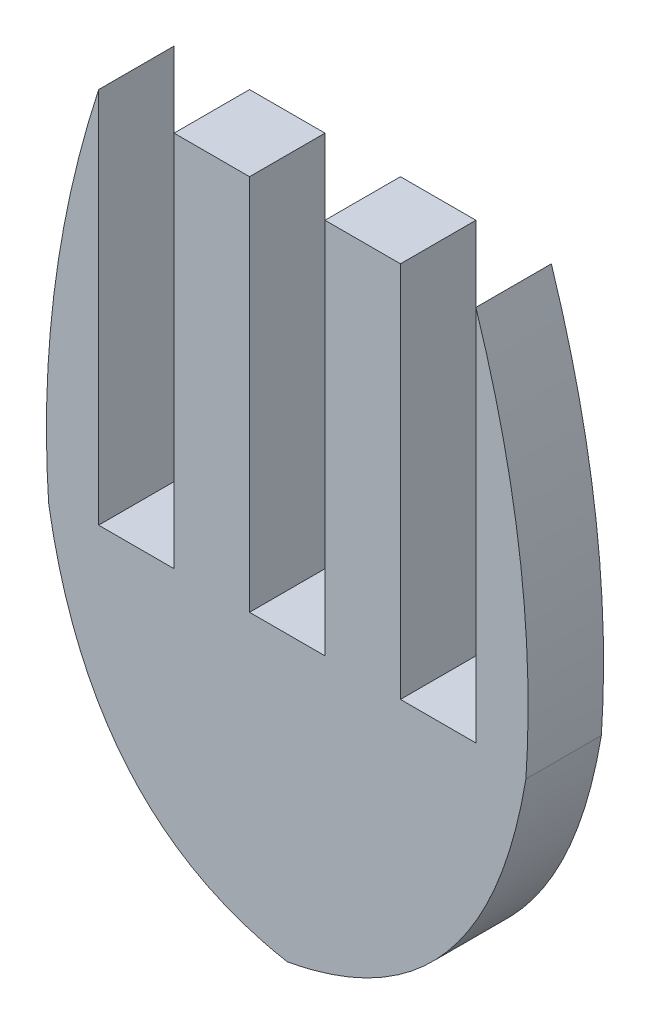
ISO-10303-21;
HEADER;
FILE_DESCRIPTION(('STEP AP214'),'2;1');
FILE_NAME('part.step','',(''),(''),'','','');
FILE_SCHEMA(('AUTOMOTIVE_DESIGN { 1 0 10303 214 1 1 1 1 }'));
ENDSEC;
DATA;
#1=APPLICATION_CONTEXT('core data for automotive mechanical design processes');
#2=APPLICATION_PROTOCOL_DEFINITION('international standard','automotive_design',2000,#1);
#3=PRODUCT_CONTEXT('',#1,'mechanical');
#4=PRODUCT('Part','Part','',(#3));
#5=PRODUCT_RELATED_PRODUCT_CATEGORY('part','',(#4));
#6=PRODUCT_DEFINITION_FORMATION('','',#4);
#7=PRODUCT_DEFINITION_CONTEXT('part definition',#1,'design');
#8=PRODUCT_DEFINITION('design','',#6,#7);
#9=PRODUCT_DEFINITION_SHAPE('','',#8);
#10=(LENGTH_UNIT() NAMED_UNIT(*) SI_UNIT(.MILLI.,.METRE.));
#11=(NAMED_UNIT(*) PLANE_ANGLE_UNIT() SI_UNIT($,.RADIAN.));
#12=(NAMED_UNIT(*) SI_UNIT($,.STERADIAN.) SOLID_ANGLE_UNIT());
#13=UNCERTAINTY_MEASURE_WITH_UNIT(LENGTH_MEASURE(1.E-05),#10,'distance_accuracy_value','');
#14=(GEOMETRIC_REPRESENTATION_CONTEXT(3) GLOBAL_UNCERTAINTY_ASSIGNED_CONTEXT((#13)) GLOBAL_UNIT_ASSIGNED_CONTEXT((#10,
#11,#12)) REPRESENTATION_CONTEXT('',''));
#15=CARTESIAN_POINT('',(0.,0.,0.));
#16=DIRECTION('',(0.,0.,1.));
#17=DIRECTION('',(1.,0.,0.));
#18=AXIS2_PLACEMENT_3D('',#15,#16,#17);
#19=CARTESIAN_POINT('',(-7.03477586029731,2.29793960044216,3.));
#20=DIRECTION('',(0.,1.,0.));
#21=DIRECTION('',(0.,0.,1.));
#22=AXIS2_PLACEMENT_3D('',#19,#20,#21);
#23=PLANE('',#22);
#24=DIRECTION('',(1.,0.,0.));
#25=VECTOR('',#24,1.);
#26=CARTESIAN_POINT('',(-7.03477586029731,2.29793960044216,0.));
#27=LINE('',#26,#25);
#28=CARTESIAN_POINT('',(-7.03477586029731,2.29793960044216,0.));
#29=VERTEX_POINT('',#28);
#30=CARTESIAN_POINT('',(-4.03477586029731,2.29793960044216,0.));
#31=VERTEX_POINT('',#30);
#32=EDGE_CURVE('E271',#29,#31,#27,.T.);
#33=ORIENTED_EDGE('',*,*,#32,.F.);
#34=DIRECTION('',(0.,0.,-1.));
#35=VECTOR('',#34,1.);
#36=CARTESIAN_POINT('',(-7.03477586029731,2.29793960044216,3.));
#37=LINE('',#36,#35);
#38=CARTESIAN_POINT('',(-7.03477586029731,2.29793960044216,3.));
#39=VERTEX_POINT('',#38);
#40=EDGE_CURVE('E11',#39,#29,#37,.T.);
#41=ORIENTED_EDGE('',*,*,#40,.F.);
#42=DIRECTION('',(1.,0.,0.));
#43=VECTOR('',#42,1.);
#44=CARTESIAN_POINT('',(-7.03477586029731,2.29793960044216,3.));
#45=LINE('',#44,#43);
#46=CARTESIAN_POINT('',(-4.03477586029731,2.29793960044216,3.));
#47=VERTEX_POINT('',#46);
#48=EDGE_CURVE('E237',#39,#47,#45,.T.);
#49=ORIENTED_EDGE('',*,*,#48,.T.);
#50=DIRECTION('',(0.,0.,-1.));
#51=VECTOR('',#50,1.);
#52=CARTESIAN_POINT('',(-4.03477586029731,2.29793960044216,3.));
#53=LINE('',#52,#51);
#54=EDGE_CURVE('E42',#47,#31,#53,.T.);
#55=ORIENTED_EDGE('',*,*,#54,.T.);
#56=EDGE_LOOP('',(#33,#41,#49,#55));
#57=FACE_BOUND('',#56,.T.);
#58=ADVANCED_FACE('F39',(#57),#23,.T.);
#59=CARTESIAN_POINT('',(-7.03477586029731,17.2979396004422,3.));
#60=DIRECTION('',(1.,0.,0.));
#61=DIRECTION('',(0.,1.,0.));
#62=AXIS2_PLACEMENT_3D('',#59,#60,#61);
#63=PLANE('',#62);
#64=DIRECTION('',(0.,-1.,0.));
#65=VECTOR('',#64,1.);
#66=CARTESIAN_POINT('',(-7.03477586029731,17.2979396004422,0.));
#67=LINE('',#66,#65);
#68=CARTESIAN_POINT('',(-7.03477586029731,17.2979396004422,0.));
#69=VERTEX_POINT('',#68);
#70=EDGE_CURVE('E238',#69,#29,#67,.T.);
#71=ORIENTED_EDGE('',*,*,#70,.F.);
#72=DIRECTION('',(0.,0.,-1.));
#73=VECTOR('',#72,1.);
#74=CARTESIAN_POINT('',(-7.03477586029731,17.2979396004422,3.));
#75=LINE('',#74,#73);
#76=CARTESIAN_POINT('',(-7.03477586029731,17.2979396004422,3.));
#77=VERTEX_POINT('',#76);
#78=EDGE_CURVE('E48',#77,#69,#75,.T.);
#79=ORIENTED_EDGE('',*,*,#78,.F.);
#80=DIRECTION('',(0.,-1.,0.));
#81=VECTOR('',#80,1.);
#82=CARTESIAN_POINT('',(-7.03477586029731,17.2979396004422,3.));
#83=LINE('',#82,#81);
#84=EDGE_CURVE('E158',#77,#39,#83,.T.);
#85=ORIENTED_EDGE('',*,*,#84,.T.);
#86=ORIENTED_EDGE('',*,*,#40,.T.);
#87=EDGE_LOOP('',(#71,#79,#85,#86));
#88=FACE_BOUND('',#87,.T.);
#89=ADVANCED_FACE('F364',(#88),#63,.T.);
#90=CARTESIAN_POINT('',(-7.03477586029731,17.2979396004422,3.));
#91=CARTESIAN_POINT('',(-9.53500148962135,9.55546838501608,3.));
#92=CARTESIAN_POINT('',(-9.0227830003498,2.04965131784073,3.));
#93=B_SPLINE_CURVE_WITH_KNOTS('',2,(#90,#91,#92),.UNSPECIFIED.,.F.,.F.,(3,3),(0.,
0.883494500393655),.UNSPECIFIED.);
#94=DIRECTION('',(0.,0.,-1.));
#95=VECTOR('',#94,1.);
#96=SURFACE_OF_LINEAR_EXTRUSION('',#93,#95);
#97=CARTESIAN_POINT('',(-7.03477586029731,17.2979396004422,0.));
#98=CARTESIAN_POINT('',(-9.53500148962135,9.55546838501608,0.));
#99=CARTESIAN_POINT('',(-9.0227830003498,2.04965131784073,0.));
#100=B_SPLINE_CURVE_WITH_KNOTS('',2,(#97,#98,#99),.UNSPECIFIED.,.F.,.F.,(3,3),(0.,
0.883494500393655),.UNSPECIFIED.);
#101=CARTESIAN_POINT('',(-9.0227830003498,2.04965131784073,0.));
#102=VERTEX_POINT('',#101);
#103=EDGE_CURVE('E163',#69,#102,#100,.T.);
#104=ORIENTED_EDGE('',*,*,#103,.T.);
#105=DIRECTION('',(0.,0.,-1.));
#106=VECTOR('',#105,1.);
#107=CARTESIAN_POINT('',(-9.0227830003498,2.04965131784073,3.));
#108=LINE('',#107,#106);
#109=CARTESIAN_POINT('',(-9.0227830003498,2.04965131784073,3.));
#110=VERTEX_POINT('',#109);
#111=EDGE_CURVE('E161',#110,#102,#108,.T.);
#112=ORIENTED_EDGE('',*,*,#111,.F.);
#113=EDGE_CURVE('E151',#77,#110,#93,.T.);
#114=ORIENTED_EDGE('',*,*,#113,.F.);
#115=ORIENTED_EDGE('',*,*,#78,.T.);
#116=EDGE_LOOP('',(#104,#112,#114,#115));
#117=FACE_BOUND('',#116,.T.);
#118=ADVANCED_FACE('F162',(#117),#96,.F.);
#119=CARTESIAN_POINT('',(-9.0227830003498,2.04965131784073,3.));
#120=CARTESIAN_POINT('',(-7.40663522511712,-7.56443030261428,3.));
#121=CARTESIAN_POINT('',(0.465224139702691,-8.98733026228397,3.));
#122=B_SPLINE_CURVE_WITH_KNOTS('',2,(#119,#120,#121),.UNSPECIFIED.,.F.,.F.,(3,3),(0.,1.),.UNSPECIFIED.);
#123=DIRECTION('',(0.,0.,-1.));
#124=VECTOR('',#123,1.);
#125=SURFACE_OF_LINEAR_EXTRUSION('',#122,#124);
#126=CARTESIAN_POINT('',(-9.0227830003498,2.04965131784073,0.));
#127=CARTESIAN_POINT('',(-7.40663522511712,-7.56443030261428,0.));
#128=CARTESIAN_POINT('',(0.465224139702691,-8.98733026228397,0.));
#129=B_SPLINE_CURVE_WITH_KNOTS('',2,(#126,#127,#128),.UNSPECIFIED.,.F.,.F.,(3,3),(0.,1.),.UNSPECIFIED.);
#130=CARTESIAN_POINT('',(0.465224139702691,-8.98733026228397,0.));
#131=VERTEX_POINT('',#130);
#132=EDGE_CURVE('E243',#102,#131,#129,.T.);
#133=ORIENTED_EDGE('',*,*,#132,.T.);
#134=DIRECTION('',(0.,0.,-1.));
#135=VECTOR('',#134,1.);
#136=CARTESIAN_POINT('',(0.465224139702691,-8.98733026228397,3.));
#137=LINE('',#136,#135);
#138=CARTESIAN_POINT('',(0.465224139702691,-8.98733026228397,3.));
#139=VERTEX_POINT('',#138);
#140=EDGE_CURVE('E167',#139,#131,#137,.T.);
#141=ORIENTED_EDGE('',*,*,#140,.F.);
#142=EDGE_CURVE('E156',#110,#139,#122,.T.);
#143=ORIENTED_EDGE('',*,*,#142,.F.);
#144=ORIENTED_EDGE('',*,*,#111,.T.);
#145=EDGE_LOOP('',(#133,#141,#143,#144));
#146=FACE_BOUND('',#145,.T.);
#147=ADVANCED_FACE('F169',(#146),#125,.F.);
#148=CARTESIAN_POINT('',(9.95323127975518,2.04965131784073,3.));
#149=CARTESIAN_POINT('',(8.33708350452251,-7.56443030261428,3.));
#150=CARTESIAN_POINT('',(0.465224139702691,-8.98733026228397,3.));
#151=B_SPLINE_CURVE_WITH_KNOTS('',2,(#148,#149,#150),.UNSPECIFIED.,.F.,.F.,(3,3),(0.,1.),.UNSPECIFIED.);
#152=DIRECTION('',(0.,0.,-1.));
#153=VECTOR('',#152,1.);
#154=SURFACE_OF_LINEAR_EXTRUSION('',#151,#153);
#155=CARTESIAN_POINT('',(9.95323127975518,2.04965131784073,0.));
#156=CARTESIAN_POINT('',(8.33708350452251,-7.56443030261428,0.));
#157=CARTESIAN_POINT('',(0.465224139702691,-8.98733026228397,0.));
#158=B_SPLINE_CURVE_WITH_KNOTS('',2,(#155,#156,#157),.UNSPECIFIED.,.F.,.F.,(3,3),(0.,1.),.UNSPECIFIED.);
#159=CARTESIAN_POINT('',(9.95323127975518,2.04965131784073,0.));
#160=VERTEX_POINT('',#159);
#161=EDGE_CURVE('E305',#160,#131,#158,.T.);
#162=ORIENTED_EDGE('',*,*,#161,.F.);
#163=DIRECTION('',(0.,0.,-1.));
#164=VECTOR('',#163,1.);
#165=CARTESIAN_POINT('',(9.95323127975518,2.04965131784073,3.));
#166=LINE('',#165,#164);
#167=CARTESIAN_POINT('',(9.95323127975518,2.04965131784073,3.));
#168=VERTEX_POINT('',#167);
#169=EDGE_CURVE('E251',#168,#160,#166,.T.);
#170=ORIENTED_EDGE('',*,*,#169,.F.);
#171=EDGE_CURVE('E171',#168,#139,#151,.T.);
#172=ORIENTED_EDGE('',*,*,#171,.T.);
#173=ORIENTED_EDGE('',*,*,#140,.T.);
#174=EDGE_LOOP('',(#162,#170,#172,#173));
#175=FACE_BOUND('',#174,.T.);
#176=ADVANCED_FACE('F193',(#175),#154,.T.);
#177=CARTESIAN_POINT('',(7.96522413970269,17.2979396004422,3.));
#178=CARTESIAN_POINT('',(10.4654497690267,9.55546838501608,3.));
#179=CARTESIAN_POINT('',(9.95323127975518,2.04965131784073,3.));
#180=B_SPLINE_CURVE_WITH_KNOTS('',2,(#177,#178,#179),.UNSPECIFIED.,.F.,.F.,(3,3),(0.,
0.883494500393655),.UNSPECIFIED.);
#181=DIRECTION('',(0.,0.,-1.));
#182=VECTOR('',#181,1.);
#183=SURFACE_OF_LINEAR_EXTRUSION('',#180,#182);
#184=CARTESIAN_POINT('',(7.96522413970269,17.2979396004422,0.));
#185=CARTESIAN_POINT('',(10.4654497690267,9.55546838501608,0.));
#186=CARTESIAN_POINT('',(9.95323127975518,2.04965131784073,0.));
#187=B_SPLINE_CURVE_WITH_KNOTS('',2,(#184,#185,#186),.UNSPECIFIED.,.F.,.F.,(3,3),(0.,
0.883494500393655),.UNSPECIFIED.);
#188=CARTESIAN_POINT('',(7.96522413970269,17.2979396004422,0.));
#189=VERTEX_POINT('',#188);
#190=EDGE_CURVE('E300',#189,#160,#187,.T.);
#191=ORIENTED_EDGE('',*,*,#190,.F.);
#192=DIRECTION('',(0.,0.,-1.));
#193=VECTOR('',#192,1.);
#194=CARTESIAN_POINT('',(7.96522413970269,17.2979396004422,3.));
#195=LINE('',#194,#193);
#196=CARTESIAN_POINT('',(7.96522413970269,17.2979396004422,3.));
#197=VERTEX_POINT('',#196);
#198=EDGE_CURVE('E253',#197,#189,#195,.T.);
#199=ORIENTED_EDGE('',*,*,#198,.F.);
#200=EDGE_CURVE('E173',#197,#168,#180,.T.);
#201=ORIENTED_EDGE('',*,*,#200,.T.);
#202=ORIENTED_EDGE('',*,*,#169,.T.);
#203=EDGE_LOOP('',(#191,#199,#201,#202));
#204=FACE_BOUND('',#203,.T.);
#205=ADVANCED_FACE('F197',(#204),#183,.T.);
#206=CARTESIAN_POINT('',(7.96522413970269,2.29793960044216,3.));
#207=DIRECTION('',(-1.,0.,0.));
#208=DIRECTION('',(0.,0.,1.));
#209=AXIS2_PLACEMENT_3D('',#206,#207,#208);
#210=PLANE('',#209);
#211=DIRECTION('',(0.,1.,0.));
#212=VECTOR('',#211,1.);
#213=CARTESIAN_POINT('',(7.96522413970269,2.29793960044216,0.));
#214=LINE('',#213,#212);
#215=CARTESIAN_POINT('',(7.96522413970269,2.29793960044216,0.));
#216=VERTEX_POINT('',#215);
#217=EDGE_CURVE('E297',#216,#189,#214,.T.);
#218=ORIENTED_EDGE('',*,*,#217,.F.);
#219=DIRECTION('',(0.,0.,-1.));
#220=VECTOR('',#219,1.);
#221=CARTESIAN_POINT('',(7.96522413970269,2.29793960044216,3.));
#222=LINE('',#221,#220);
#223=CARTESIAN_POINT('',(7.96522413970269,2.29793960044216,3.));
#224=VERTEX_POINT('',#223);
#225=EDGE_CURVE('E255',#224,#216,#222,.T.);
#226=ORIENTED_EDGE('',*,*,#225,.F.);
#227=DIRECTION('',(0.,1.,0.));
#228=VECTOR('',#227,1.);
#229=CARTESIAN_POINT('',(7.96522413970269,2.29793960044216,3.));
#230=LINE('',#229,#228);
#231=EDGE_CURVE('E209',#224,#197,#230,.T.);
#232=ORIENTED_EDGE('',*,*,#231,.T.);
#233=ORIENTED_EDGE('',*,*,#198,.T.);
#234=EDGE_LOOP('',(#218,#226,#232,#233));
#235=FACE_BOUND('',#234,.T.);
#236=ADVANCED_FACE('F201',(#235),#210,.T.);
#237=CARTESIAN_POINT('',(4.96522413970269,2.29793960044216,3.));
#238=DIRECTION('',(0.,1.,0.));
#239=DIRECTION('',(0.,0.,1.));
#240=AXIS2_PLACEMENT_3D('',#237,#238,#239);
#241=PLANE('',#240);
#242=DIRECTION('',(1.,0.,0.));
#243=VECTOR('',#242,1.);
#244=CARTESIAN_POINT('',(4.96522413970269,2.29793960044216,0.));
#245=LINE('',#244,#243);
#246=CARTESIAN_POINT('',(4.96522413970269,2.29793960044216,0.));
#247=VERTEX_POINT('',#246);
#248=EDGE_CURVE('E294',#247,#216,#245,.T.);
#249=ORIENTED_EDGE('',*,*,#248,.F.);
#250=DIRECTION('',(0.,0.,-1.));
#251=VECTOR('',#250,1.);
#252=CARTESIAN_POINT('',(4.96522413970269,2.29793960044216,3.));
#253=LINE('',#252,#251);
#254=CARTESIAN_POINT('',(4.96522413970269,2.29793960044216,3.));
#255=VERTEX_POINT('',#254);
#256=EDGE_CURVE('E257',#255,#247,#253,.T.);
#257=ORIENTED_EDGE('',*,*,#256,.F.);
#258=DIRECTION('',(1.,0.,0.));
#259=VECTOR('',#258,1.);
#260=CARTESIAN_POINT('',(4.96522413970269,2.29793960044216,3.));
#261=LINE('',#260,#259);
#262=EDGE_CURVE('E215',#255,#224,#261,.T.);
#263=ORIENTED_EDGE('',*,*,#262,.T.);
#264=ORIENTED_EDGE('',*,*,#225,.T.);
#265=EDGE_LOOP('',(#249,#257,#263,#264));
#266=FACE_BOUND('',#265,.T.);
#267=ADVANCED_FACE('F331',(#266),#241,.T.);
#268=CARTESIAN_POINT('',(4.96522413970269,17.2979396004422,3.));
#269=DIRECTION('',(1.,0.,0.));
#270=DIRECTION('',(0.,0.,-1.));
#271=AXIS2_PLACEMENT_3D('',#268,#269,#270);
#272=PLANE('',#271);
#273=DIRECTION('',(0.,-1.,0.));
#274=VECTOR('',#273,1.);
#275=CARTESIAN_POINT('',(4.96522413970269,17.2979396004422,0.));
#276=LINE('',#275,#274);
#277=CARTESIAN_POINT('',(4.96522413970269,17.2979396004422,0.));
#278=VERTEX_POINT('',#277);
#279=EDGE_CURVE('E291',#278,#247,#276,.T.);
#280=ORIENTED_EDGE('',*,*,#279,.F.);
#281=DIRECTION('',(0.,0.,-1.));
#282=VECTOR('',#281,1.);
#283=CARTESIAN_POINT('',(4.96522413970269,17.2979396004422,3.));
#284=LINE('',#283,#282);
#285=CARTESIAN_POINT('',(4.96522413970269,17.2979396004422,3.));
#286=VERTEX_POINT('',#285);
#287=EDGE_CURVE('E259',#286,#278,#284,.T.);
#288=ORIENTED_EDGE('',*,*,#287,.F.);
#289=DIRECTION('',(0.,-1.,0.));
#290=VECTOR('',#289,1.);
#291=CARTESIAN_POINT('',(4.96522413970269,17.2979396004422,3.));
#292=LINE('',#291,#290);
#293=EDGE_CURVE('E218',#286,#255,#292,.T.);
#294=ORIENTED_EDGE('',*,*,#293,.T.);
#295=ORIENTED_EDGE('',*,*,#256,.T.);
#296=EDGE_LOOP('',(#280,#288,#294,#295));
#297=FACE_BOUND('',#296,.T.);
#298=ADVANCED_FACE('F334',(#297),#272,.T.);
#299=CARTESIAN_POINT('',(1.96522413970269,17.2979396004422,3.));
#300=DIRECTION('',(0.,1.,0.));
#301=DIRECTION('',(0.,0.,1.));
#302=AXIS2_PLACEMENT_3D('',#299,#300,#301);
#303=PLANE('',#302);
#304=DIRECTION('',(1.,0.,0.));
#305=VECTOR('',#304,1.);
#306=CARTESIAN_POINT('',(1.96522413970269,17.2979396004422,0.));
#307=LINE('',#306,#305);
#308=CARTESIAN_POINT('',(1.96522413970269,17.2979396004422,0.));
#309=VERTEX_POINT('',#308);
#310=EDGE_CURVE('E288',#309,#278,#307,.T.);
#311=ORIENTED_EDGE('',*,*,#310,.F.);
#312=DIRECTION('',(0.,0.,-1.));
#313=VECTOR('',#312,1.);
#314=CARTESIAN_POINT('',(1.96522413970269,17.2979396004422,3.));
#315=LINE('',#314,#313);
#316=CARTESIAN_POINT('',(1.96522413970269,17.2979396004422,3.));
#317=VERTEX_POINT('',#316);
#318=EDGE_CURVE('E261',#317,#309,#315,.T.);
#319=ORIENTED_EDGE('',*,*,#318,.F.);
#320=DIRECTION('',(1.,0.,0.));
#321=VECTOR('',#320,1.);
#322=CARTESIAN_POINT('',(1.96522413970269,17.2979396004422,3.));
#323=LINE('',#322,#321);
#324=EDGE_CURVE('E221',#317,#286,#323,.T.);
#325=ORIENTED_EDGE('',*,*,#324,.T.);
#326=ORIENTED_EDGE('',*,*,#287,.T.);
#327=EDGE_LOOP('',(#311,#319,#325,#326));
#328=FACE_BOUND('',#327,.T.);
#329=ADVANCED_FACE('F339',(#328),#303,.T.);
#330=CARTESIAN_POINT('',(1.96522413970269,2.29793960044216,3.));
#331=DIRECTION('',(-1.,0.,0.));
#332=DIRECTION('',(0.,0.,1.));
#333=AXIS2_PLACEMENT_3D('',#330,#331,#332);
#334=PLANE('',#333);
#335=DIRECTION('',(0.,1.,0.));
#336=VECTOR('',#335,1.);
#337=CARTESIAN_POINT('',(1.96522413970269,2.29793960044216,0.));
#338=LINE('',#337,#336);
#339=CARTESIAN_POINT('',(1.96522413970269,2.29793960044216,0.));
#340=VERTEX_POINT('',#339);
#341=EDGE_CURVE('E285',#340,#309,#338,.T.);
#342=ORIENTED_EDGE('',*,*,#341,.F.);
#343=DIRECTION('',(0.,0.,-1.));
#344=VECTOR('',#343,1.);
#345=CARTESIAN_POINT('',(1.96522413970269,2.29793960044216,3.));
#346=LINE('',#345,#344);
#347=CARTESIAN_POINT('',(1.96522413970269,2.29793960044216,3.));
#348=VERTEX_POINT('',#347);
#349=EDGE_CURVE('E263',#348,#340,#346,.T.);
#350=ORIENTED_EDGE('',*,*,#349,.F.);
#351=DIRECTION('',(0.,1.,0.));
#352=VECTOR('',#351,1.);
#353=CARTESIAN_POINT('',(1.96522413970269,2.29793960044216,3.));
#354=LINE('',#353,#352);
#355=EDGE_CURVE('E224',#348,#317,#354,.T.);
#356=ORIENTED_EDGE('',*,*,#355,.T.);
#357=ORIENTED_EDGE('',*,*,#318,.T.);
#358=EDGE_LOOP('',(#342,#350,#356,#357));
#359=FACE_BOUND('',#358,.T.);
#360=ADVANCED_FACE('F342',(#359),#334,.T.);
#361=CARTESIAN_POINT('',(-1.03477586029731,2.29793960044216,3.));
#362=DIRECTION('',(0.,1.,0.));
#363=DIRECTION('',(0.,0.,1.));
#364=AXIS2_PLACEMENT_3D('',#361,#362,#363);
#365=PLANE('',#364);
#366=DIRECTION('',(1.,0.,0.));
#367=VECTOR('',#366,1.);
#368=CARTESIAN_POINT('',(-1.03477586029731,2.29793960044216,0.));
#369=LINE('',#368,#367);
#370=CARTESIAN_POINT('',(-1.03477586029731,2.29793960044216,0.));
#371=VERTEX_POINT('',#370);
#372=EDGE_CURVE('E282',#371,#340,#369,.T.);
#373=ORIENTED_EDGE('',*,*,#372,.F.);
#374=DIRECTION('',(0.,0.,-1.));
#375=VECTOR('',#374,1.);
#376=CARTESIAN_POINT('',(-1.03477586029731,2.29793960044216,3.));
#377=LINE('',#376,#375);
#378=CARTESIAN_POINT('',(-1.03477586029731,2.29793960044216,3.));
#379=VERTEX_POINT('',#378);
#380=EDGE_CURVE('E265',#379,#371,#377,.T.);
#381=ORIENTED_EDGE('',*,*,#380,.F.);
#382=DIRECTION('',(1.,0.,0.));
#383=VECTOR('',#382,1.);
#384=CARTESIAN_POINT('',(-1.03477586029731,2.29793960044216,3.));
#385=LINE('',#384,#383);
#386=EDGE_CURVE('E227',#379,#348,#385,.T.);
#387=ORIENTED_EDGE('',*,*,#386,.T.);
#388=ORIENTED_EDGE('',*,*,#349,.T.);
#389=EDGE_LOOP('',(#373,#381,#387,#388));
#390=FACE_BOUND('',#389,.T.);
#391=ADVANCED_FACE('F346',(#390),#365,.T.);
#392=CARTESIAN_POINT('',(-1.03477586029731,2.29793960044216,3.));
#393=DIRECTION('',(-1.,0.,0.));
#394=DIRECTION('',(0.,0.,1.));
#395=AXIS2_PLACEMENT_3D('',#392,#393,#394);
#396=PLANE('',#395);
#397=DIRECTION('',(0.,1.,0.));
#398=VECTOR('',#397,1.);
#399=CARTESIAN_POINT('',(-1.03477586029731,2.29793960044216,0.));
#400=LINE('',#399,#398);
#401=CARTESIAN_POINT('',(-1.03477586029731,17.2979396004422,0.));
#402=VERTEX_POINT('',#401);
#403=EDGE_CURVE('E279',#371,#402,#400,.T.);
#404=ORIENTED_EDGE('',*,*,#403,.T.);
#405=DIRECTION('',(0.,0.,-1.));
#406=VECTOR('',#405,1.);
#407=CARTESIAN_POINT('',(-1.03477586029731,17.2979396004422,3.));
#408=LINE('',#407,#406);
#409=CARTESIAN_POINT('',(-1.03477586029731,17.2979396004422,3.));
#410=VERTEX_POINT('',#409);
#411=EDGE_CURVE('E267',#410,#402,#408,.T.);
#412=ORIENTED_EDGE('',*,*,#411,.F.);
#413=DIRECTION('',(0.,1.,0.));
#414=VECTOR('',#413,1.);
#415=CARTESIAN_POINT('',(-1.03477586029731,2.29793960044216,3.));
#416=LINE('',#415,#414);
#417=EDGE_CURVE('E230',#379,#410,#416,.T.);
#418=ORIENTED_EDGE('',*,*,#417,.F.);
#419=ORIENTED_EDGE('',*,*,#380,.T.);
#420=EDGE_LOOP('',(#404,#412,#418,#419));
#421=FACE_BOUND('',#420,.T.);
#422=ADVANCED_FACE('F351',(#421),#396,.F.);
#423=CARTESIAN_POINT('',(-4.03477586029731,17.2979396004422,3.));
#424=DIRECTION('',(0.,1.,0.));
#425=DIRECTION('',(0.,0.,1.));
#426=AXIS2_PLACEMENT_3D('',#423,#424,#425);
#427=PLANE('',#426);
#428=DIRECTION('',(1.,0.,0.));
#429=VECTOR('',#428,1.);
#430=CARTESIAN_POINT('',(-4.03477586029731,17.2979396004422,0.));
#431=LINE('',#430,#429);
#432=CARTESIAN_POINT('',(-4.03477586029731,17.2979396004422,0.));
#433=VERTEX_POINT('',#432);
#434=EDGE_CURVE('E276',#433,#402,#431,.T.);
#435=ORIENTED_EDGE('',*,*,#434,.F.);
#436=DIRECTION('',(0.,0.,-1.));
#437=VECTOR('',#436,1.);
#438=CARTESIAN_POINT('',(-4.03477586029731,17.2979396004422,3.));
#439=LINE('',#438,#437);
#440=CARTESIAN_POINT('',(-4.03477586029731,17.2979396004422,3.));
#441=VERTEX_POINT('',#440);
#442=EDGE_CURVE('E268',#441,#433,#439,.T.);
#443=ORIENTED_EDGE('',*,*,#442,.F.);
#444=DIRECTION('',(1.,0.,0.));
#445=VECTOR('',#444,1.);
#446=CARTESIAN_POINT('',(-4.03477586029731,17.2979396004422,3.));
#447=LINE('',#446,#445);
#448=EDGE_CURVE('E232',#441,#410,#447,.T.);
#449=ORIENTED_EDGE('',*,*,#448,.T.);
#450=ORIENTED_EDGE('',*,*,#411,.T.);
#451=EDGE_LOOP('',(#435,#443,#449,#450));
#452=FACE_BOUND('',#451,.T.);
#453=ADVANCED_FACE('F356',(#452),#427,.T.);
#454=CARTESIAN_POINT('',(-4.03477586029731,2.29793960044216,3.));
#455=DIRECTION('',(-1.,0.,0.));
#456=DIRECTION('',(0.,0.,1.));
#457=AXIS2_PLACEMENT_3D('',#454,#455,#456);
#458=PLANE('',#457);
#459=DIRECTION('',(0.,1.,0.));
#460=VECTOR('',#459,1.);
#461=CARTESIAN_POINT('',(-4.03477586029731,2.29793960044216,0.));
#462=LINE('',#461,#460);
#463=EDGE_CURVE('E273',#31,#433,#462,.T.);
#464=ORIENTED_EDGE('',*,*,#463,.F.);
#465=ORIENTED_EDGE('',*,*,#54,.F.);
#466=DIRECTION('',(0.,1.,0.));
#467=VECTOR('',#466,1.);
#468=CARTESIAN_POINT('',(-4.03477586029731,2.29793960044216,3.));
#469=LINE('',#468,#467);
#470=EDGE_CURVE('E235',#47,#441,#469,.T.);
#471=ORIENTED_EDGE('',*,*,#470,.T.);
#472=ORIENTED_EDGE('',*,*,#442,.T.);
#473=EDGE_LOOP('',(#464,#465,#471,#472));
#474=FACE_BOUND('',#473,.T.);
#475=ADVANCED_FACE('F354',(#474),#458,.T.);
#476=CARTESIAN_POINT('',(9.71233873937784,9.61463192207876,3.));
#477=DIRECTION('',(0.,0.,1.));
#478=DIRECTION('',(1.,0.,0.));
#479=AXIS2_PLACEMENT_3D('',#476,#477,#478);
#480=PLANE('',#479);
#481=ORIENTED_EDGE('',*,*,#48,.F.);
#482=ORIENTED_EDGE('',*,*,#84,.F.);
#483=ORIENTED_EDGE('',*,*,#113,.T.);
#484=ORIENTED_EDGE('',*,*,#142,.T.);
#485=ORIENTED_EDGE('',*,*,#171,.F.);
#486=ORIENTED_EDGE('',*,*,#200,.F.);
#487=ORIENTED_EDGE('',*,*,#231,.F.);
#488=ORIENTED_EDGE('',*,*,#262,.F.);
#489=ORIENTED_EDGE('',*,*,#293,.F.);
#490=ORIENTED_EDGE('',*,*,#324,.F.);
#491=ORIENTED_EDGE('',*,*,#355,.F.);
#492=ORIENTED_EDGE('',*,*,#386,.F.);
#493=ORIENTED_EDGE('',*,*,#417,.T.);
#494=ORIENTED_EDGE('',*,*,#448,.F.);
#495=ORIENTED_EDGE('',*,*,#470,.F.);
#496=EDGE_LOOP('',(#481,#482,#483,#484,#485,#486,#487,#488,#489,#490,#491,#492,#493,#494,#495));
#497=FACE_BOUND('',#496,.T.);
#498=ADVANCED_FACE('F153',(#497),#480,.T.);
#499=CARTESIAN_POINT('',(9.71233873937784,9.61463192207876,0.));
#500=DIRECTION('',(0.,0.,1.));
#501=DIRECTION('',(1.,0.,0.));
#502=AXIS2_PLACEMENT_3D('',#499,#500,#501);
#503=PLANE('',#502);
#504=ORIENTED_EDGE('',*,*,#32,.T.);
#505=ORIENTED_EDGE('',*,*,#463,.T.);
#506=ORIENTED_EDGE('',*,*,#434,.T.);
#507=ORIENTED_EDGE('',*,*,#403,.F.);
#508=ORIENTED_EDGE('',*,*,#372,.T.);
#509=ORIENTED_EDGE('',*,*,#341,.T.);
#510=ORIENTED_EDGE('',*,*,#310,.T.);
#511=ORIENTED_EDGE('',*,*,#279,.T.);
#512=ORIENTED_EDGE('',*,*,#248,.T.);
#513=ORIENTED_EDGE('',*,*,#217,.T.);
#514=ORIENTED_EDGE('',*,*,#190,.T.);
#515=ORIENTED_EDGE('',*,*,#161,.T.);
#516=ORIENTED_EDGE('',*,*,#132,.F.);
#517=ORIENTED_EDGE('',*,*,#103,.F.);
#518=ORIENTED_EDGE('',*,*,#70,.T.);
#519=EDGE_LOOP('',(#504,#505,#506,#507,#508,#509,#510,#511,#512,#513,#514,#515,#516,#517,#518));
#520=FACE_BOUND('',#519,.T.);
#521=ADVANCED_FACE('F321',(#520),#503,.F.);
#522=CLOSED_SHELL('',(#58,#89,#118,#147,#176,#205,#236,#267,#298,#329,#360,#391,#422,#453,#475,
#498,#521));
#523=MANIFOLD_SOLID_BREP('B2',#522);
#524=ADVANCED_BREP_SHAPE_REPRESENTATION('',(#18,#523),#14);
#525=SHAPE_DEFINITION_REPRESENTATION(#9,#524);
ENDSEC;
END-ISO-10303-21;
